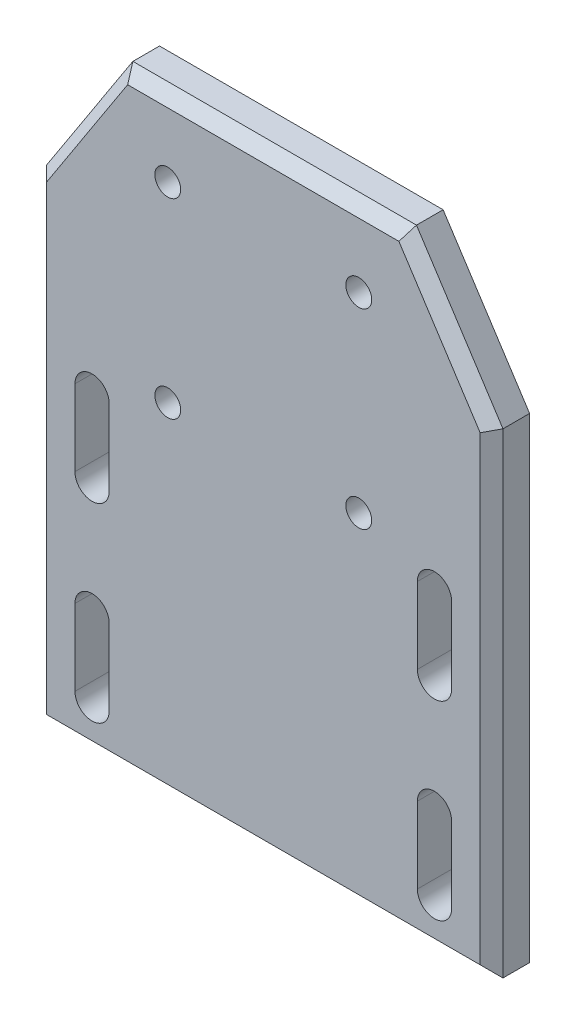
ISO-10303-21;
HEADER;
FILE_DESCRIPTION(('STEP AP214'),'2;1');
FILE_NAME('part.step','',(''),(''),'','','');
FILE_SCHEMA(('AUTOMOTIVE_DESIGN { 1 0 10303 214 1 1 1 1 }'));
ENDSEC;
DATA;
#1=APPLICATION_CONTEXT('core data for automotive mechanical design processes');
#2=APPLICATION_PROTOCOL_DEFINITION('international standard','automotive_design',2000,#1);
#3=PRODUCT_CONTEXT('',#1,'mechanical');
#4=PRODUCT('Part','Part','',(#3));
#5=PRODUCT_RELATED_PRODUCT_CATEGORY('part','',(#4));
#6=PRODUCT_DEFINITION_FORMATION('','',#4);
#7=PRODUCT_DEFINITION_CONTEXT('part definition',#1,'design');
#8=PRODUCT_DEFINITION('design','',#6,#7);
#9=PRODUCT_DEFINITION_SHAPE('','',#8);
#10=(LENGTH_UNIT() NAMED_UNIT(*) SI_UNIT(.MILLI.,.METRE.));
#11=(NAMED_UNIT(*) PLANE_ANGLE_UNIT() SI_UNIT($,.RADIAN.));
#12=(NAMED_UNIT(*) SI_UNIT($,.STERADIAN.) SOLID_ANGLE_UNIT());
#13=UNCERTAINTY_MEASURE_WITH_UNIT(LENGTH_MEASURE(1.E-05),#10,'distance_accuracy_value','');
#14=(GEOMETRIC_REPRESENTATION_CONTEXT(3) GLOBAL_UNCERTAINTY_ASSIGNED_CONTEXT((#13)) GLOBAL_UNIT_ASSIGNED_CONTEXT((#10,
#11,#12)) REPRESENTATION_CONTEXT('',''));
#15=CARTESIAN_POINT('',(0.,0.,0.));
#16=DIRECTION('',(0.,0.,1.));
#17=DIRECTION('',(1.,0.,0.));
#18=AXIS2_PLACEMENT_3D('',#15,#16,#17);
#19=CARTESIAN_POINT('',(-60.,-115.,10.));
#20=DIRECTION('',(0.,0.,1.));
#21=DIRECTION('',(1.,0.,0.));
#22=AXIS2_PLACEMENT_3D('',#19,#20,#21);
#23=PLANE('',#22);
#24=DIRECTION('',(0.,1.,0.));
#25=VECTOR('',#24,1.);
#26=CARTESIAN_POINT('',(57.,9.99999999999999,10.));
#27=LINE('',#26,#25);
#28=CARTESIAN_POINT('',(57.,-112.,10.));
#29=VERTEX_POINT('',#28);
#30=CARTESIAN_POINT('',(57.,9.11135951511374,10.));
#31=VERTEX_POINT('',#30);
#32=EDGE_CURVE('E363',#29,#31,#27,.T.);
#33=ORIENTED_EDGE('',*,*,#32,.T.);
#34=DIRECTION('',(-0.544639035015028,0.838670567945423,0.));
#35=VECTOR('',#34,1.);
#36=CARTESIAN_POINT('',(34.7547225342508,43.3660828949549,10.));
#37=LINE('',#36,#35);
#38=CARTESIAN_POINT('',(35.6418671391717,42.,10.));
#39=VERTEX_POINT('',#38);
#40=EDGE_CURVE('E388',#31,#39,#37,.T.);
#41=ORIENTED_EDGE('',*,*,#40,.T.);
#42=DIRECTION('',(-1.,0.,0.));
#43=VECTOR('',#42,1.);
#44=CARTESIAN_POINT('',(-37.2707342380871,42.,10.));
#45=LINE('',#44,#43);
#46=CARTESIAN_POINT('',(-35.6418671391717,42.,10.));
#47=VERTEX_POINT('',#46);
#48=EDGE_CURVE('E386',#39,#47,#45,.T.);
#49=ORIENTED_EDGE('',*,*,#48,.T.);
#50=DIRECTION('',(-0.544639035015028,-0.838670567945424,0.));
#51=VECTOR('',#50,1.);
#52=CARTESIAN_POINT('',(-57.4839882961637,8.36608289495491,10.));
#53=LINE('',#52,#51);
#54=CARTESIAN_POINT('',(-57.,9.11135951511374,10.));
#55=VERTEX_POINT('',#54);
#56=EDGE_CURVE('E384',#47,#55,#53,.T.);
#57=ORIENTED_EDGE('',*,*,#56,.T.);
#58=DIRECTION('',(0.,-1.,0.));
#59=VECTOR('',#58,1.);
#60=CARTESIAN_POINT('',(-57.,-115.,10.));
#61=LINE('',#60,#59);
#62=CARTESIAN_POINT('',(-57.,-112.,10.));
#63=VERTEX_POINT('',#62);
#64=EDGE_CURVE('E382',#55,#63,#61,.T.);
#65=ORIENTED_EDGE('',*,*,#64,.T.);
#66=DIRECTION('',(1.,0.,0.));
#67=VECTOR('',#66,1.);
#68=CARTESIAN_POINT('',(60.,-112.,10.));
#69=LINE('',#68,#67);
#70=EDGE_CURVE('E380',#63,#29,#69,.T.);
#71=ORIENTED_EDGE('',*,*,#70,.T.);
#72=EDGE_LOOP('',(#33,#41,#49,#57,#65,#71));
#73=FACE_BOUND('',#72,.T.);
#74=CARTESIAN_POINT('',(-25.1022907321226,25.1022907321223,10.));
#75=DIRECTION('',(0.,0.,1.));
#76=DIRECTION('',(1.,0.,0.));
#77=AXIS2_PLACEMENT_3D('',#74,#75,#76);
#78=CIRCLE('',#77,3.39999999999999);
#79=CARTESIAN_POINT('',(-21.7022907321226,25.1022907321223,10.));
#80=VERTEX_POINT('',#79);
#81=EDGE_CURVE('E378',#80,#80,#78,.T.);
#82=ORIENTED_EDGE('',*,*,#81,.F.);
#83=EDGE_LOOP('',(#82));
#84=FACE_BOUND('',#83,.T.);
#85=CARTESIAN_POINT('',(25.102290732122,25.1022907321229,10.));
#86=DIRECTION('',(0.,0.,1.));
#87=DIRECTION('',(1.,0.,0.));
#88=AXIS2_PLACEMENT_3D('',#85,#86,#87);
#89=CIRCLE('',#88,3.39999999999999);
#90=CARTESIAN_POINT('',(28.502290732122,25.1022907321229,10.));
#91=VERTEX_POINT('',#90);
#92=EDGE_CURVE('E374',#91,#91,#89,.T.);
#93=ORIENTED_EDGE('',*,*,#92,.F.);
#94=EDGE_LOOP('',(#93));
#95=FACE_BOUND('',#94,.T.);
#96=CARTESIAN_POINT('',(25.1022907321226,-25.1022907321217,10.));
#97=DIRECTION('',(0.,0.,1.));
#98=DIRECTION('',(1.,0.,0.));
#99=AXIS2_PLACEMENT_3D('',#96,#97,#98);
#100=CIRCLE('',#99,3.39999999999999);
#101=CARTESIAN_POINT('',(28.5022907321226,-25.1022907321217,10.));
#102=VERTEX_POINT('',#101);
#103=EDGE_CURVE('E370',#102,#102,#100,.T.);
#104=ORIENTED_EDGE('',*,*,#103,.F.);
#105=EDGE_LOOP('',(#104));
#106=FACE_BOUND('',#105,.T.);
#107=CARTESIAN_POINT('',(-25.102290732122,-25.1022907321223,10.));
#108=DIRECTION('',(0.,0.,1.));
#109=DIRECTION('',(1.,0.,0.));
#110=AXIS2_PLACEMENT_3D('',#107,#108,#109);
#111=CIRCLE('',#110,3.39999999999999);
#112=CARTESIAN_POINT('',(-21.702290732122,-25.1022907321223,10.));
#113=VERTEX_POINT('',#112);
#114=EDGE_CURVE('E366',#113,#113,#111,.T.);
#115=ORIENTED_EDGE('',*,*,#114,.F.);
#116=EDGE_LOOP('',(#115));
#117=FACE_BOUND('',#116,.T.);
#118=DIRECTION('',(0.,1.,0.));
#119=VECTOR('',#118,1.);
#120=CARTESIAN_POINT('',(49.5,-82.9999999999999,10.));
#121=LINE('',#120,#119);
#122=CARTESIAN_POINT('',(49.5,-103.,10.));
#123=VERTEX_POINT('',#122);
#124=CARTESIAN_POINT('',(49.5,-82.9999999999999,10.));
#125=VERTEX_POINT('',#124);
#126=EDGE_CURVE('E243',#123,#125,#121,.T.);
#127=ORIENTED_EDGE('',*,*,#126,.F.);
#128=CARTESIAN_POINT('',(45.,-103.,10.));
#129=DIRECTION('',(0.,0.,1.));
#130=DIRECTION('',(-1.,0.,0.));
#131=AXIS2_PLACEMENT_3D('',#128,#129,#130);
#132=CIRCLE('',#131,4.5);
#133=CARTESIAN_POINT('',(40.5,-103.,10.));
#134=VERTEX_POINT('',#133);
#135=EDGE_CURVE('E241',#134,#123,#132,.T.);
#136=ORIENTED_EDGE('',*,*,#135,.F.);
#137=DIRECTION('',(0.,-1.,0.));
#138=VECTOR('',#137,1.);
#139=CARTESIAN_POINT('',(40.5,-82.9999999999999,10.));
#140=LINE('',#139,#138);
#141=CARTESIAN_POINT('',(40.5,-82.9999999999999,10.));
#142=VERTEX_POINT('',#141);
#143=EDGE_CURVE('E249',#142,#134,#140,.T.);
#144=ORIENTED_EDGE('',*,*,#143,.F.);
#145=CARTESIAN_POINT('',(45.,-82.9999999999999,10.));
#146=DIRECTION('',(0.,0.,1.));
#147=DIRECTION('',(-1.,0.,0.));
#148=AXIS2_PLACEMENT_3D('',#145,#146,#147);
#149=CIRCLE('',#148,4.5);
#150=EDGE_CURVE('E246',#125,#142,#149,.T.);
#151=ORIENTED_EDGE('',*,*,#150,.F.);
#152=EDGE_LOOP('',(#127,#136,#144,#151));
#153=FACE_BOUND('',#152,.T.);
#154=DIRECTION('',(0.,-1.,0.));
#155=VECTOR('',#154,1.);
#156=CARTESIAN_POINT('',(-49.5,-83.,10.));
#157=LINE('',#156,#155);
#158=CARTESIAN_POINT('',(-49.5,-83.,10.));
#159=VERTEX_POINT('',#158);
#160=CARTESIAN_POINT('',(-49.5,-103.,10.));
#161=VERTEX_POINT('',#160);
#162=EDGE_CURVE('E305',#159,#161,#157,.T.);
#163=ORIENTED_EDGE('',*,*,#162,.F.);
#164=CARTESIAN_POINT('',(-45.,-83.,10.));
#165=DIRECTION('',(0.,0.,1.));
#166=DIRECTION('',(1.,0.,0.));
#167=AXIS2_PLACEMENT_3D('',#164,#165,#166);
#168=CIRCLE('',#167,4.5);
#169=CARTESIAN_POINT('',(-40.5,-83.,10.));
#170=VERTEX_POINT('',#169);
#171=EDGE_CURVE('E303',#170,#159,#168,.T.);
#172=ORIENTED_EDGE('',*,*,#171,.F.);
#173=DIRECTION('',(0.,1.,0.));
#174=VECTOR('',#173,1.);
#175=CARTESIAN_POINT('',(-40.5,-83.,10.));
#176=LINE('',#175,#174);
#177=CARTESIAN_POINT('',(-40.5,-103.,10.));
#178=VERTEX_POINT('',#177);
#179=EDGE_CURVE('E311',#178,#170,#176,.T.);
#180=ORIENTED_EDGE('',*,*,#179,.F.);
#181=CARTESIAN_POINT('',(-45.,-103.,10.));
#182=DIRECTION('',(0.,0.,1.));
#183=DIRECTION('',(1.,0.,0.));
#184=AXIS2_PLACEMENT_3D('',#181,#182,#183);
#185=CIRCLE('',#184,4.5);
#186=EDGE_CURVE('E308',#161,#178,#185,.T.);
#187=ORIENTED_EDGE('',*,*,#186,.F.);
#188=EDGE_LOOP('',(#163,#172,#180,#187));
#189=FACE_BOUND('',#188,.T.);
#190=DIRECTION('',(0.,-1.,0.));
#191=VECTOR('',#190,1.);
#192=CARTESIAN_POINT('',(-49.5,-53.,10.));
#193=LINE('',#192,#191);
#194=CARTESIAN_POINT('',(-49.5,-33.,10.));
#195=VERTEX_POINT('',#194);
#196=CARTESIAN_POINT('',(-49.5,-53.,10.));
#197=VERTEX_POINT('',#196);
#198=EDGE_CURVE('E274',#195,#197,#193,.T.);
#199=ORIENTED_EDGE('',*,*,#198,.F.);
#200=CARTESIAN_POINT('',(-45.,-33.,10.));
#201=DIRECTION('',(0.,0.,1.));
#202=DIRECTION('',(-1.,0.,0.));
#203=AXIS2_PLACEMENT_3D('',#200,#201,#202);
#204=CIRCLE('',#203,4.5);
#205=CARTESIAN_POINT('',(-40.5,-33.,10.));
#206=VERTEX_POINT('',#205);
#207=EDGE_CURVE('E272',#206,#195,#204,.T.);
#208=ORIENTED_EDGE('',*,*,#207,.F.);
#209=DIRECTION('',(0.,1.,0.));
#210=VECTOR('',#209,1.);
#211=CARTESIAN_POINT('',(-40.5,-53.,10.));
#212=LINE('',#211,#210);
#213=CARTESIAN_POINT('',(-40.5,-53.,10.));
#214=VERTEX_POINT('',#213);
#215=EDGE_CURVE('E280',#214,#206,#212,.T.);
#216=ORIENTED_EDGE('',*,*,#215,.F.);
#217=CARTESIAN_POINT('',(-45.,-53.,10.));
#218=DIRECTION('',(0.,0.,1.));
#219=DIRECTION('',(-1.,0.,0.));
#220=AXIS2_PLACEMENT_3D('',#217,#218,#219);
#221=CIRCLE('',#220,4.5);
#222=EDGE_CURVE('E277',#197,#214,#221,.T.);
#223=ORIENTED_EDGE('',*,*,#222,.F.);
#224=EDGE_LOOP('',(#199,#208,#216,#223));
#225=FACE_BOUND('',#224,.T.);
#226=DIRECTION('',(0.,1.,0.));
#227=VECTOR('',#226,1.);
#228=CARTESIAN_POINT('',(49.5,-53.,10.));
#229=LINE('',#228,#227);
#230=CARTESIAN_POINT('',(49.5,-53.,10.));
#231=VERTEX_POINT('',#230);
#232=CARTESIAN_POINT('',(49.5,-32.9999999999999,10.));
#233=VERTEX_POINT('',#232);
#234=EDGE_CURVE('E208',#231,#233,#229,.T.);
#235=ORIENTED_EDGE('',*,*,#234,.F.);
#236=CARTESIAN_POINT('',(45.,-53.,10.));
#237=DIRECTION('',(0.,0.,1.));
#238=DIRECTION('',(1.,0.,0.));
#239=AXIS2_PLACEMENT_3D('',#236,#237,#238);
#240=CIRCLE('',#239,4.5);
#241=CARTESIAN_POINT('',(40.5,-53.,10.));
#242=VERTEX_POINT('',#241);
#243=EDGE_CURVE('E198',#242,#231,#240,.T.);
#244=ORIENTED_EDGE('',*,*,#243,.F.);
#245=DIRECTION('',(0.,-1.,0.));
#246=VECTOR('',#245,1.);
#247=CARTESIAN_POINT('',(40.5,-53.,10.));
#248=LINE('',#247,#246);
#249=CARTESIAN_POINT('',(40.5,-32.9999999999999,10.));
#250=VERTEX_POINT('',#249);
#251=EDGE_CURVE('E223',#250,#242,#248,.T.);
#252=ORIENTED_EDGE('',*,*,#251,.F.);
#253=CARTESIAN_POINT('',(45.,-32.9999999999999,10.));
#254=DIRECTION('',(0.,0.,1.));
#255=DIRECTION('',(1.,0.,0.));
#256=AXIS2_PLACEMENT_3D('',#253,#254,#255);
#257=CIRCLE('',#256,4.5);
#258=EDGE_CURVE('E221',#233,#250,#257,.T.);
#259=ORIENTED_EDGE('',*,*,#258,.F.);
#260=EDGE_LOOP('',(#235,#244,#252,#259));
#261=FACE_BOUND('',#260,.T.);
#262=ADVANCED_FACE('F30',(#73,#84,#95,#106,#117,#153,#189,#225,#261),#23,.T.);
#263=CARTESIAN_POINT('',(-60.,-115.,0.));
#264=DIRECTION('',(0.,0.,1.));
#265=DIRECTION('',(1.,0.,0.));
#266=AXIS2_PLACEMENT_3D('',#263,#264,#265);
#267=PLANE('',#266);
#268=CARTESIAN_POINT('',(-25.1022907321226,25.1022907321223,0.));
#269=DIRECTION('',(0.,0.,1.));
#270=DIRECTION('',(1.,0.,0.));
#271=AXIS2_PLACEMENT_3D('',#268,#269,#270);
#272=CIRCLE('',#271,3.39999999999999);
#273=CARTESIAN_POINT('',(-21.7022907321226,25.1022907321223,0.));
#274=VERTEX_POINT('',#273);
#275=EDGE_CURVE('E375',#274,#274,#272,.T.);
#276=ORIENTED_EDGE('',*,*,#275,.T.);
#277=EDGE_LOOP('',(#276));
#278=FACE_BOUND('',#277,.T.);
#279=CARTESIAN_POINT('',(25.102290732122,25.1022907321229,0.));
#280=DIRECTION('',(0.,0.,1.));
#281=DIRECTION('',(1.,0.,0.));
#282=AXIS2_PLACEMENT_3D('',#279,#280,#281);
#283=CIRCLE('',#282,3.39999999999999);
#284=CARTESIAN_POINT('',(28.502290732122,25.1022907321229,0.));
#285=VERTEX_POINT('',#284);
#286=EDGE_CURVE('E371',#285,#285,#283,.T.);
#287=ORIENTED_EDGE('',*,*,#286,.T.);
#288=EDGE_LOOP('',(#287));
#289=FACE_BOUND('',#288,.T.);
#290=CARTESIAN_POINT('',(25.1022907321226,-25.1022907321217,0.));
#291=DIRECTION('',(0.,0.,1.));
#292=DIRECTION('',(1.,0.,0.));
#293=AXIS2_PLACEMENT_3D('',#290,#291,#292);
#294=CIRCLE('',#293,3.39999999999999);
#295=CARTESIAN_POINT('',(28.5022907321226,-25.1022907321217,0.));
#296=VERTEX_POINT('',#295);
#297=EDGE_CURVE('E367',#296,#296,#294,.T.);
#298=ORIENTED_EDGE('',*,*,#297,.T.);
#299=EDGE_LOOP('',(#298));
#300=FACE_BOUND('',#299,.T.);
#301=CARTESIAN_POINT('',(-25.102290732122,-25.1022907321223,0.));
#302=DIRECTION('',(0.,0.,1.));
#303=DIRECTION('',(1.,0.,0.));
#304=AXIS2_PLACEMENT_3D('',#301,#302,#303);
#305=CIRCLE('',#304,3.39999999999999);
#306=CARTESIAN_POINT('',(-21.702290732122,-25.1022907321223,0.));
#307=VERTEX_POINT('',#306);
#308=EDGE_CURVE('E230',#307,#307,#305,.T.);
#309=ORIENTED_EDGE('',*,*,#308,.T.);
#310=EDGE_LOOP('',(#309));
#311=FACE_BOUND('',#310,.T.);
#312=CARTESIAN_POINT('',(45.,-103.,0.));
#313=DIRECTION('',(0.,0.,1.));
#314=DIRECTION('',(-1.,0.,0.));
#315=AXIS2_PLACEMENT_3D('',#312,#313,#314);
#316=CIRCLE('',#315,4.5);
#317=CARTESIAN_POINT('',(40.5,-103.,0.));
#318=VERTEX_POINT('',#317);
#319=CARTESIAN_POINT('',(49.5,-103.,0.));
#320=VERTEX_POINT('',#319);
#321=EDGE_CURVE('E216',#318,#320,#316,.T.);
#322=ORIENTED_EDGE('',*,*,#321,.T.);
#323=DIRECTION('',(0.,1.,0.));
#324=VECTOR('',#323,1.);
#325=CARTESIAN_POINT('',(49.5,-82.9999999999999,0.));
#326=LINE('',#325,#324);
#327=CARTESIAN_POINT('',(49.5,-82.9999999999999,0.));
#328=VERTEX_POINT('',#327);
#329=EDGE_CURVE('E254',#320,#328,#326,.T.);
#330=ORIENTED_EDGE('',*,*,#329,.T.);
#331=CARTESIAN_POINT('',(45.,-82.9999999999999,0.));
#332=DIRECTION('',(0.,0.,1.));
#333=DIRECTION('',(-1.,0.,0.));
#334=AXIS2_PLACEMENT_3D('',#331,#332,#333);
#335=CIRCLE('',#334,4.5);
#336=CARTESIAN_POINT('',(40.5,-82.9999999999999,0.));
#337=VERTEX_POINT('',#336);
#338=EDGE_CURVE('E257',#328,#337,#335,.T.);
#339=ORIENTED_EDGE('',*,*,#338,.T.);
#340=DIRECTION('',(0.,-1.,0.));
#341=VECTOR('',#340,1.);
#342=CARTESIAN_POINT('',(40.5,-82.9999999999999,0.));
#343=LINE('',#342,#341);
#344=EDGE_CURVE('E244',#337,#318,#343,.T.);
#345=ORIENTED_EDGE('',*,*,#344,.T.);
#346=EDGE_LOOP('',(#322,#330,#339,#345));
#347=FACE_BOUND('',#346,.T.);
#348=CARTESIAN_POINT('',(-45.,-83.,0.));
#349=DIRECTION('',(0.,0.,1.));
#350=DIRECTION('',(1.,0.,0.));
#351=AXIS2_PLACEMENT_3D('',#348,#349,#350);
#352=CIRCLE('',#351,4.5);
#353=CARTESIAN_POINT('',(-40.5,-83.,0.));
#354=VERTEX_POINT('',#353);
#355=CARTESIAN_POINT('',(-49.5,-83.,0.));
#356=VERTEX_POINT('',#355);
#357=EDGE_CURVE('E302',#354,#356,#352,.T.);
#358=ORIENTED_EDGE('',*,*,#357,.T.);
#359=DIRECTION('',(0.,-1.,0.));
#360=VECTOR('',#359,1.);
#361=CARTESIAN_POINT('',(-49.5,-83.,0.));
#362=LINE('',#361,#360);
#363=CARTESIAN_POINT('',(-49.5,-103.,0.));
#364=VERTEX_POINT('',#363);
#365=EDGE_CURVE('E316',#356,#364,#362,.T.);
#366=ORIENTED_EDGE('',*,*,#365,.T.);
#367=CARTESIAN_POINT('',(-45.,-103.,0.));
#368=DIRECTION('',(0.,0.,1.));
#369=DIRECTION('',(1.,0.,0.));
#370=AXIS2_PLACEMENT_3D('',#367,#368,#369);
#371=CIRCLE('',#370,4.5);
#372=CARTESIAN_POINT('',(-40.5,-103.,0.));
#373=VERTEX_POINT('',#372);
#374=EDGE_CURVE('E319',#364,#373,#371,.T.);
#375=ORIENTED_EDGE('',*,*,#374,.T.);
#376=DIRECTION('',(0.,1.,0.));
#377=VECTOR('',#376,1.);
#378=CARTESIAN_POINT('',(-40.5,-83.,0.));
#379=LINE('',#378,#377);
#380=EDGE_CURVE('E306',#373,#354,#379,.T.);
#381=ORIENTED_EDGE('',*,*,#380,.T.);
#382=EDGE_LOOP('',(#358,#366,#375,#381));
#383=FACE_BOUND('',#382,.T.);
#384=DIRECTION('',(0.,-1.,0.));
#385=VECTOR('',#384,1.);
#386=CARTESIAN_POINT('',(-60.,9.99999999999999,0.));
#387=LINE('',#386,#385);
#388=CARTESIAN_POINT('',(-60.,9.99999999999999,0.));
#389=VERTEX_POINT('',#388);
#390=CARTESIAN_POINT('',(-60.,-115.,0.));
#391=VERTEX_POINT('',#390);
#392=EDGE_CURVE('E333',#389,#391,#387,.T.);
#393=ORIENTED_EDGE('',*,*,#392,.F.);
#394=DIRECTION('',(-0.544639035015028,-0.838670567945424,0.));
#395=VECTOR('',#394,1.);
#396=CARTESIAN_POINT('',(-37.2707342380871,45.,0.));
#397=LINE('',#396,#395);
#398=CARTESIAN_POINT('',(-37.2707342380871,45.,0.));
#399=VERTEX_POINT('',#398);
#400=EDGE_CURVE('E348',#399,#389,#397,.T.);
#401=ORIENTED_EDGE('',*,*,#400,.F.);
#402=DIRECTION('',(-1.,0.,0.));
#403=VECTOR('',#402,1.);
#404=CARTESIAN_POINT('',(37.2707342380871,45.,0.));
#405=LINE('',#404,#403);
#406=CARTESIAN_POINT('',(37.2707342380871,45.,0.));
#407=VERTEX_POINT('',#406);
#408=EDGE_CURVE('E345',#407,#399,#405,.T.);
#409=ORIENTED_EDGE('',*,*,#408,.F.);
#410=DIRECTION('',(-0.544639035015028,0.838670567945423,0.));
#411=VECTOR('',#410,1.);
#412=CARTESIAN_POINT('',(60.,9.99999999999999,0.));
#413=LINE('',#412,#411);
#414=CARTESIAN_POINT('',(60.,9.99999999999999,0.));
#415=VERTEX_POINT('',#414);
#416=EDGE_CURVE('E342',#415,#407,#413,.T.);
#417=ORIENTED_EDGE('',*,*,#416,.F.);
#418=DIRECTION('',(0.,1.,0.));
#419=VECTOR('',#418,1.);
#420=CARTESIAN_POINT('',(60.,-115.,0.));
#421=LINE('',#420,#419);
#422=CARTESIAN_POINT('',(60.,-115.,0.));
#423=VERTEX_POINT('',#422);
#424=EDGE_CURVE('E339',#423,#415,#421,.T.);
#425=ORIENTED_EDGE('',*,*,#424,.F.);
#426=DIRECTION('',(1.,0.,0.));
#427=VECTOR('',#426,1.);
#428=CARTESIAN_POINT('',(-60.,-115.,0.));
#429=LINE('',#428,#427);
#430=EDGE_CURVE('E336',#391,#423,#429,.T.);
#431=ORIENTED_EDGE('',*,*,#430,.F.);
#432=EDGE_LOOP('',(#393,#401,#409,#417,#425,#431));
#433=FACE_BOUND('',#432,.T.);
#434=CARTESIAN_POINT('',(-45.,-33.,0.));
#435=DIRECTION('',(0.,0.,1.));
#436=DIRECTION('',(-1.,0.,0.));
#437=AXIS2_PLACEMENT_3D('',#434,#435,#436);
#438=CIRCLE('',#437,4.5);
#439=CARTESIAN_POINT('',(-40.5,-33.,0.));
#440=VERTEX_POINT('',#439);
#441=CARTESIAN_POINT('',(-49.5,-33.,0.));
#442=VERTEX_POINT('',#441);
#443=EDGE_CURVE('E271',#440,#442,#438,.T.);
#444=ORIENTED_EDGE('',*,*,#443,.T.);
#445=DIRECTION('',(0.,-1.,0.));
#446=VECTOR('',#445,1.);
#447=CARTESIAN_POINT('',(-49.5,-53.,0.));
#448=LINE('',#447,#446);
#449=CARTESIAN_POINT('',(-49.5,-53.,0.));
#450=VERTEX_POINT('',#449);
#451=EDGE_CURVE('E285',#442,#450,#448,.T.);
#452=ORIENTED_EDGE('',*,*,#451,.T.);
#453=CARTESIAN_POINT('',(-45.,-53.,0.));
#454=DIRECTION('',(0.,0.,1.));
#455=DIRECTION('',(-1.,0.,0.));
#456=AXIS2_PLACEMENT_3D('',#453,#454,#455);
#457=CIRCLE('',#456,4.5);
#458=CARTESIAN_POINT('',(-40.5,-53.,0.));
#459=VERTEX_POINT('',#458);
#460=EDGE_CURVE('E288',#450,#459,#457,.T.);
#461=ORIENTED_EDGE('',*,*,#460,.T.);
#462=DIRECTION('',(0.,1.,0.));
#463=VECTOR('',#462,1.);
#464=CARTESIAN_POINT('',(-40.5,-53.,0.));
#465=LINE('',#464,#463);
#466=EDGE_CURVE('E275',#459,#440,#465,.T.);
#467=ORIENTED_EDGE('',*,*,#466,.T.);
#468=EDGE_LOOP('',(#444,#452,#461,#467));
#469=FACE_BOUND('',#468,.T.);
#470=CARTESIAN_POINT('',(45.,-53.,0.));
#471=DIRECTION('',(0.,0.,1.));
#472=DIRECTION('',(1.,0.,0.));
#473=AXIS2_PLACEMENT_3D('',#470,#471,#472);
#474=CIRCLE('',#473,4.5);
#475=CARTESIAN_POINT('',(40.5,-53.,0.));
#476=VERTEX_POINT('',#475);
#477=CARTESIAN_POINT('',(49.5,-53.,0.));
#478=VERTEX_POINT('',#477);
#479=EDGE_CURVE('E228',#476,#478,#474,.T.);
#480=ORIENTED_EDGE('',*,*,#479,.T.);
#481=DIRECTION('',(0.,1.,0.));
#482=VECTOR('',#481,1.);
#483=CARTESIAN_POINT('',(49.5,-53.,0.));
#484=LINE('',#483,#482);
#485=CARTESIAN_POINT('',(49.5,-32.9999999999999,0.));
#486=VERTEX_POINT('',#485);
#487=EDGE_CURVE('E215',#478,#486,#484,.T.);
#488=ORIENTED_EDGE('',*,*,#487,.T.);
#489=CARTESIAN_POINT('',(45.,-32.9999999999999,0.));
#490=DIRECTION('',(0.,0.,1.));
#491=DIRECTION('',(1.,0.,0.));
#492=AXIS2_PLACEMENT_3D('',#489,#490,#491);
#493=CIRCLE('',#492,4.5);
#494=CARTESIAN_POINT('',(40.5,-32.9999999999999,0.));
#495=VERTEX_POINT('',#494);
#496=EDGE_CURVE('E232',#486,#495,#493,.T.);
#497=ORIENTED_EDGE('',*,*,#496,.T.);
#498=DIRECTION('',(0.,-1.,0.));
#499=VECTOR('',#498,1.);
#500=CARTESIAN_POINT('',(40.5,-53.,0.));
#501=LINE('',#500,#499);
#502=EDGE_CURVE('E209',#495,#476,#501,.T.);
#503=ORIENTED_EDGE('',*,*,#502,.T.);
#504=EDGE_LOOP('',(#480,#488,#497,#503));
#505=FACE_BOUND('',#504,.T.);
#506=ADVANCED_FACE('F436',(#278,#289,#300,#311,#347,#383,#433,#469,#505),#267,.F.);
#507=CARTESIAN_POINT('',(-60.,9.99999999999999,10.));
#508=DIRECTION('',(1.,0.,0.));
#509=DIRECTION('',(0.,1.,0.));
#510=AXIS2_PLACEMENT_3D('',#507,#508,#509);
#511=PLANE('',#510);
#512=DIRECTION('',(0.,0.,-1.));
#513=VECTOR('',#512,1.);
#514=CARTESIAN_POINT('',(-60.,-115.,10.));
#515=LINE('',#514,#513);
#516=CARTESIAN_POINT('',(-60.,-115.,7.));
#517=VERTEX_POINT('',#516);
#518=EDGE_CURVE('E361',#517,#391,#515,.T.);
#519=ORIENTED_EDGE('',*,*,#518,.F.);
#520=DIRECTION('',(0.,1.,0.));
#521=VECTOR('',#520,1.);
#522=CARTESIAN_POINT('',(-60.,9.99999999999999,7.));
#523=LINE('',#522,#521);
#524=CARTESIAN_POINT('',(-60.,9.99999999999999,7.));
#525=VERTEX_POINT('',#524);
#526=EDGE_CURVE('E398',#517,#525,#523,.T.);
#527=ORIENTED_EDGE('',*,*,#526,.T.);
#528=DIRECTION('',(0.,0.,-1.));
#529=VECTOR('',#528,1.);
#530=CARTESIAN_POINT('',(-60.,9.99999999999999,10.));
#531=LINE('',#530,#529);
#532=EDGE_CURVE('E351',#525,#389,#531,.T.);
#533=ORIENTED_EDGE('',*,*,#532,.T.);
#534=ORIENTED_EDGE('',*,*,#392,.T.);
#535=EDGE_LOOP('',(#519,#527,#533,#534));
#536=FACE_BOUND('',#535,.T.);
#537=ADVANCED_FACE('F502',(#536),#511,.F.);
#538=CARTESIAN_POINT('',(-60.,-115.,10.));
#539=DIRECTION('',(0.,1.,0.));
#540=DIRECTION('',(-1.,0.,0.));
#541=AXIS2_PLACEMENT_3D('',#538,#539,#540);
#542=PLANE('',#541);
#543=DIRECTION('',(0.,0.,-1.));
#544=VECTOR('',#543,1.);
#545=CARTESIAN_POINT('',(60.,-115.,10.));
#546=LINE('',#545,#544);
#547=CARTESIAN_POINT('',(60.,-115.,7.));
#548=VERTEX_POINT('',#547);
#549=EDGE_CURVE('E359',#548,#423,#546,.T.);
#550=ORIENTED_EDGE('',*,*,#549,.F.);
#551=DIRECTION('',(-1.,0.,0.));
#552=VECTOR('',#551,1.);
#553=CARTESIAN_POINT('',(-60.,-115.,7.));
#554=LINE('',#553,#552);
#555=EDGE_CURVE('E39',#548,#517,#554,.T.);
#556=ORIENTED_EDGE('',*,*,#555,.T.);
#557=ORIENTED_EDGE('',*,*,#518,.T.);
#558=ORIENTED_EDGE('',*,*,#430,.T.);
#559=EDGE_LOOP('',(#550,#556,#557,#558));
#560=FACE_BOUND('',#559,.T.);
#561=ADVANCED_FACE('F518',(#560),#542,.F.);
#562=CARTESIAN_POINT('',(60.,-115.,10.));
#563=DIRECTION('',(-1.,0.,0.));
#564=DIRECTION('',(0.,-1.,0.));
#565=AXIS2_PLACEMENT_3D('',#562,#563,#564);
#566=PLANE('',#565);
#567=DIRECTION('',(0.,0.,-1.));
#568=VECTOR('',#567,1.);
#569=CARTESIAN_POINT('',(60.,9.99999999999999,10.));
#570=LINE('',#569,#568);
#571=CARTESIAN_POINT('',(60.,9.99999999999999,7.));
#572=VERTEX_POINT('',#571);
#573=EDGE_CURVE('E357',#572,#415,#570,.T.);
#574=ORIENTED_EDGE('',*,*,#573,.F.);
#575=DIRECTION('',(0.,-1.,0.));
#576=VECTOR('',#575,1.);
#577=CARTESIAN_POINT('',(60.,-115.,7.));
#578=LINE('',#577,#576);
#579=EDGE_CURVE('E11',#572,#548,#578,.T.);
#580=ORIENTED_EDGE('',*,*,#579,.T.);
#581=ORIENTED_EDGE('',*,*,#549,.T.);
#582=ORIENTED_EDGE('',*,*,#424,.T.);
#583=EDGE_LOOP('',(#574,#580,#581,#582));
#584=FACE_BOUND('',#583,.T.);
#585=ADVANCED_FACE('F514',(#584),#566,.F.);
#586=CARTESIAN_POINT('',(60.,9.99999999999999,10.));
#587=DIRECTION('',(-0.838670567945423,-0.544639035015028,0.));
#588=DIRECTION('',(0.544639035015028,-0.838670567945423,0.));
#589=AXIS2_PLACEMENT_3D('',#586,#587,#588);
#590=PLANE('',#589);
#591=DIRECTION('',(0.,0.,-1.));
#592=VECTOR('',#591,1.);
#593=CARTESIAN_POINT('',(37.2707342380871,45.,10.));
#594=LINE('',#593,#592);
#595=CARTESIAN_POINT('',(37.2707342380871,45.,7.));
#596=VERTEX_POINT('',#595);
#597=EDGE_CURVE('E355',#596,#407,#594,.T.);
#598=ORIENTED_EDGE('',*,*,#597,.F.);
#599=DIRECTION('',(0.544639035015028,-0.838670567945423,0.));
#600=VECTOR('',#599,1.);
#601=CARTESIAN_POINT('',(60.,9.99999999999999,7.));
#602=LINE('',#601,#600);
#603=EDGE_CURVE('E391',#596,#572,#602,.T.);
#604=ORIENTED_EDGE('',*,*,#603,.T.);
#605=ORIENTED_EDGE('',*,*,#573,.T.);
#606=ORIENTED_EDGE('',*,*,#416,.T.);
#607=EDGE_LOOP('',(#598,#604,#605,#606));
#608=FACE_BOUND('',#607,.T.);
#609=ADVANCED_FACE('F510',(#608),#590,.F.);
#610=CARTESIAN_POINT('',(37.2707342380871,45.,10.));
#611=DIRECTION('',(0.,-1.,0.));
#612=DIRECTION('',(1.,0.,0.));
#613=AXIS2_PLACEMENT_3D('',#610,#611,#612);
#614=PLANE('',#613);
#615=DIRECTION('',(0.,0.,-1.));
#616=VECTOR('',#615,1.);
#617=CARTESIAN_POINT('',(-37.2707342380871,45.,10.));
#618=LINE('',#617,#616);
#619=CARTESIAN_POINT('',(-37.2707342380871,45.,7.));
#620=VERTEX_POINT('',#619);
#621=EDGE_CURVE('E353',#620,#399,#618,.T.);
#622=ORIENTED_EDGE('',*,*,#621,.F.);
#623=DIRECTION('',(1.,0.,0.));
#624=VECTOR('',#623,1.);
#625=CARTESIAN_POINT('',(37.2707342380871,45.,7.));
#626=LINE('',#625,#624);
#627=EDGE_CURVE('E394',#620,#596,#626,.T.);
#628=ORIENTED_EDGE('',*,*,#627,.T.);
#629=ORIENTED_EDGE('',*,*,#597,.T.);
#630=ORIENTED_EDGE('',*,*,#408,.T.);
#631=EDGE_LOOP('',(#622,#628,#629,#630));
#632=FACE_BOUND('',#631,.T.);
#633=ADVANCED_FACE('F506',(#632),#614,.F.);
#634=CARTESIAN_POINT('',(-37.2707342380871,45.,10.));
#635=DIRECTION('',(0.838670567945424,-0.544639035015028,0.));
#636=DIRECTION('',(0.544639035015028,0.838670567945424,0.));
#637=AXIS2_PLACEMENT_3D('',#634,#635,#636);
#638=PLANE('',#637);
#639=ORIENTED_EDGE('',*,*,#532,.F.);
#640=DIRECTION('',(0.544639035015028,0.838670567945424,0.));
#641=VECTOR('',#640,1.);
#642=CARTESIAN_POINT('',(-37.2707342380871,45.,7.));
#643=LINE('',#642,#641);
#644=EDGE_CURVE('E396',#525,#620,#643,.T.);
#645=ORIENTED_EDGE('',*,*,#644,.T.);
#646=ORIENTED_EDGE('',*,*,#621,.T.);
#647=ORIENTED_EDGE('',*,*,#400,.T.);
#648=EDGE_LOOP('',(#639,#645,#646,#647));
#649=FACE_BOUND('',#648,.T.);
#650=ADVANCED_FACE('F497',(#649),#638,.F.);
#651=CARTESIAN_POINT('',(-45.,-83.,10.));
#652=DIRECTION('',(0.,0.,-1.));
#653=DIRECTION('',(-1.,0.,0.));
#654=AXIS2_PLACEMENT_3D('',#651,#652,#653);
#655=CYLINDRICAL_SURFACE('',#654,4.5);
#656=ORIENTED_EDGE('',*,*,#357,.F.);
#657=DIRECTION('',(0.,0.,-1.));
#658=VECTOR('',#657,1.);
#659=CARTESIAN_POINT('',(-40.5,-83.,10.));
#660=LINE('',#659,#658);
#661=EDGE_CURVE('E313',#170,#354,#660,.T.);
#662=ORIENTED_EDGE('',*,*,#661,.F.);
#663=ORIENTED_EDGE('',*,*,#171,.T.);
#664=DIRECTION('',(0.,0.,-1.));
#665=VECTOR('',#664,1.);
#666=CARTESIAN_POINT('',(-49.5,-83.,10.));
#667=LINE('',#666,#665);
#668=EDGE_CURVE('E330',#159,#356,#667,.T.);
#669=ORIENTED_EDGE('',*,*,#668,.T.);
#670=EDGE_LOOP('',(#656,#662,#663,#669));
#671=FACE_BOUND('',#670,.T.);
#672=ADVANCED_FACE('F494',(#671),#655,.F.);
#673=CARTESIAN_POINT('',(-49.5,-83.,10.));
#674=DIRECTION('',(1.,0.,0.));
#675=DIRECTION('',(0.,0.,-1.));
#676=AXIS2_PLACEMENT_3D('',#673,#674,#675);
#677=PLANE('',#676);
#678=ORIENTED_EDGE('',*,*,#365,.F.);
#679=ORIENTED_EDGE('',*,*,#668,.F.);
#680=ORIENTED_EDGE('',*,*,#162,.T.);
#681=DIRECTION('',(0.,0.,-1.));
#682=VECTOR('',#681,1.);
#683=CARTESIAN_POINT('',(-49.5,-103.,10.));
#684=LINE('',#683,#682);
#685=EDGE_CURVE('E328',#161,#364,#684,.T.);
#686=ORIENTED_EDGE('',*,*,#685,.T.);
#687=EDGE_LOOP('',(#678,#679,#680,#686));
#688=FACE_BOUND('',#687,.T.);
#689=ADVANCED_FACE('F490',(#688),#677,.T.);
#690=CARTESIAN_POINT('',(-45.,-103.,10.));
#691=DIRECTION('',(0.,0.,-1.));
#692=DIRECTION('',(-1.,0.,0.));
#693=AXIS2_PLACEMENT_3D('',#690,#691,#692);
#694=CYLINDRICAL_SURFACE('',#693,4.5);
#695=ORIENTED_EDGE('',*,*,#374,.F.);
#696=ORIENTED_EDGE('',*,*,#685,.F.);
#697=ORIENTED_EDGE('',*,*,#186,.T.);
#698=DIRECTION('',(0.,0.,-1.));
#699=VECTOR('',#698,1.);
#700=CARTESIAN_POINT('',(-40.5,-103.,10.));
#701=LINE('',#700,#699);
#702=EDGE_CURVE('E326',#178,#373,#701,.T.);
#703=ORIENTED_EDGE('',*,*,#702,.T.);
#704=EDGE_LOOP('',(#695,#696,#697,#703));
#705=FACE_BOUND('',#704,.T.);
#706=ADVANCED_FACE('F486',(#705),#694,.F.);
#707=CARTESIAN_POINT('',(-40.5,-83.,10.));
#708=DIRECTION('',(-1.,0.,0.));
#709=DIRECTION('',(0.,0.,1.));
#710=AXIS2_PLACEMENT_3D('',#707,#708,#709);
#711=PLANE('',#710);
#712=ORIENTED_EDGE('',*,*,#380,.F.);
#713=ORIENTED_EDGE('',*,*,#702,.F.);
#714=ORIENTED_EDGE('',*,*,#179,.T.);
#715=ORIENTED_EDGE('',*,*,#661,.T.);
#716=EDGE_LOOP('',(#712,#713,#714,#715));
#717=FACE_BOUND('',#716,.T.);
#718=ADVANCED_FACE('F483',(#717),#711,.T.);
#719=CARTESIAN_POINT('',(-45.,-33.,10.));
#720=DIRECTION('',(0.,0.,-1.));
#721=DIRECTION('',(-1.,0.,0.));
#722=AXIS2_PLACEMENT_3D('',#719,#720,#721);
#723=CYLINDRICAL_SURFACE('',#722,4.5);
#724=ORIENTED_EDGE('',*,*,#443,.F.);
#725=DIRECTION('',(0.,0.,-1.));
#726=VECTOR('',#725,1.);
#727=CARTESIAN_POINT('',(-40.5,-33.,10.));
#728=LINE('',#727,#726);
#729=EDGE_CURVE('E282',#206,#440,#728,.T.);
#730=ORIENTED_EDGE('',*,*,#729,.F.);
#731=ORIENTED_EDGE('',*,*,#207,.T.);
#732=DIRECTION('',(0.,0.,-1.));
#733=VECTOR('',#732,1.);
#734=CARTESIAN_POINT('',(-49.5,-33.,10.));
#735=LINE('',#734,#733);
#736=EDGE_CURVE('E299',#195,#442,#735,.T.);
#737=ORIENTED_EDGE('',*,*,#736,.T.);
#738=EDGE_LOOP('',(#724,#730,#731,#737));
#739=FACE_BOUND('',#738,.T.);
#740=ADVANCED_FACE('F462',(#739),#723,.F.);
#741=CARTESIAN_POINT('',(-49.5,-53.,10.));
#742=DIRECTION('',(1.,0.,0.));
#743=DIRECTION('',(0.,0.,-1.));
#744=AXIS2_PLACEMENT_3D('',#741,#742,#743);
#745=PLANE('',#744);
#746=ORIENTED_EDGE('',*,*,#451,.F.);
#747=ORIENTED_EDGE('',*,*,#736,.F.);
#748=ORIENTED_EDGE('',*,*,#198,.T.);
#749=DIRECTION('',(0.,0.,-1.));
#750=VECTOR('',#749,1.);
#751=CARTESIAN_POINT('',(-49.5,-53.,10.));
#752=LINE('',#751,#750);
#753=EDGE_CURVE('E297',#197,#450,#752,.T.);
#754=ORIENTED_EDGE('',*,*,#753,.T.);
#755=EDGE_LOOP('',(#746,#747,#748,#754));
#756=FACE_BOUND('',#755,.T.);
#757=ADVANCED_FACE('F454',(#756),#745,.T.);
#758=CARTESIAN_POINT('',(-45.,-53.,10.));
#759=DIRECTION('',(0.,0.,-1.));
#760=DIRECTION('',(-1.,0.,0.));
#761=AXIS2_PLACEMENT_3D('',#758,#759,#760);
#762=CYLINDRICAL_SURFACE('',#761,4.5);
#763=ORIENTED_EDGE('',*,*,#460,.F.);
#764=ORIENTED_EDGE('',*,*,#753,.F.);
#765=ORIENTED_EDGE('',*,*,#222,.T.);
#766=DIRECTION('',(0.,0.,-1.));
#767=VECTOR('',#766,1.);
#768=CARTESIAN_POINT('',(-40.5,-53.,10.));
#769=LINE('',#768,#767);
#770=EDGE_CURVE('E295',#214,#459,#769,.T.);
#771=ORIENTED_EDGE('',*,*,#770,.T.);
#772=EDGE_LOOP('',(#763,#764,#765,#771));
#773=FACE_BOUND('',#772,.T.);
#774=ADVANCED_FACE('F457',(#773),#762,.F.);
#775=CARTESIAN_POINT('',(-40.5,-53.,10.));
#776=DIRECTION('',(-1.,0.,0.));
#777=DIRECTION('',(0.,0.,1.));
#778=AXIS2_PLACEMENT_3D('',#775,#776,#777);
#779=PLANE('',#778);
#780=ORIENTED_EDGE('',*,*,#466,.F.);
#781=ORIENTED_EDGE('',*,*,#770,.F.);
#782=ORIENTED_EDGE('',*,*,#215,.T.);
#783=ORIENTED_EDGE('',*,*,#729,.T.);
#784=EDGE_LOOP('',(#780,#781,#782,#783));
#785=FACE_BOUND('',#784,.T.);
#786=ADVANCED_FACE('F465',(#785),#779,.T.);
#787=CARTESIAN_POINT('',(45.,-103.,10.));
#788=DIRECTION('',(0.,0.,-1.));
#789=DIRECTION('',(-1.,0.,0.));
#790=AXIS2_PLACEMENT_3D('',#787,#788,#789);
#791=CYLINDRICAL_SURFACE('',#790,4.5);
#792=ORIENTED_EDGE('',*,*,#321,.F.);
#793=DIRECTION('',(0.,0.,-1.));
#794=VECTOR('',#793,1.);
#795=CARTESIAN_POINT('',(40.5,-103.,10.));
#796=LINE('',#795,#794);
#797=EDGE_CURVE('E251',#134,#318,#796,.T.);
#798=ORIENTED_EDGE('',*,*,#797,.F.);
#799=ORIENTED_EDGE('',*,*,#135,.T.);
#800=DIRECTION('',(0.,0.,-1.));
#801=VECTOR('',#800,1.);
#802=CARTESIAN_POINT('',(49.5,-103.,10.));
#803=LINE('',#802,#801);
#804=EDGE_CURVE('E268',#123,#320,#803,.T.);
#805=ORIENTED_EDGE('',*,*,#804,.T.);
#806=EDGE_LOOP('',(#792,#798,#799,#805));
#807=FACE_BOUND('',#806,.T.);
#808=ADVANCED_FACE('F467',(#807),#791,.F.);
#809=CARTESIAN_POINT('',(49.5,-82.9999999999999,10.));
#810=DIRECTION('',(-1.,0.,0.));
#811=DIRECTION('',(0.,0.,1.));
#812=AXIS2_PLACEMENT_3D('',#809,#810,#811);
#813=PLANE('',#812);
#814=ORIENTED_EDGE('',*,*,#329,.F.);
#815=ORIENTED_EDGE('',*,*,#804,.F.);
#816=ORIENTED_EDGE('',*,*,#126,.T.);
#817=DIRECTION('',(0.,0.,-1.));
#818=VECTOR('',#817,1.);
#819=CARTESIAN_POINT('',(49.5,-82.9999999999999,10.));
#820=LINE('',#819,#818);
#821=EDGE_CURVE('E266',#125,#328,#820,.T.);
#822=ORIENTED_EDGE('',*,*,#821,.T.);
#823=EDGE_LOOP('',(#814,#815,#816,#822));
#824=FACE_BOUND('',#823,.T.);
#825=ADVANCED_FACE('F473',(#824),#813,.T.);
#826=CARTESIAN_POINT('',(45.,-82.9999999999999,10.));
#827=DIRECTION('',(0.,0.,-1.));
#828=DIRECTION('',(-1.,0.,0.));
#829=AXIS2_PLACEMENT_3D('',#826,#827,#828);
#830=CYLINDRICAL_SURFACE('',#829,4.5);
#831=ORIENTED_EDGE('',*,*,#338,.F.);
#832=ORIENTED_EDGE('',*,*,#821,.F.);
#833=ORIENTED_EDGE('',*,*,#150,.T.);
#834=DIRECTION('',(0.,0.,-1.));
#835=VECTOR('',#834,1.);
#836=CARTESIAN_POINT('',(40.5,-82.9999999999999,10.));
#837=LINE('',#836,#835);
#838=EDGE_CURVE('E264',#142,#337,#837,.T.);
#839=ORIENTED_EDGE('',*,*,#838,.T.);
#840=EDGE_LOOP('',(#831,#832,#833,#839));
#841=FACE_BOUND('',#840,.T.);
#842=ADVANCED_FACE('F603',(#841),#830,.F.);
#843=CARTESIAN_POINT('',(40.5,-82.9999999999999,10.));
#844=DIRECTION('',(1.,0.,0.));
#845=DIRECTION('',(0.,0.,-1.));
#846=AXIS2_PLACEMENT_3D('',#843,#844,#845);
#847=PLANE('',#846);
#848=ORIENTED_EDGE('',*,*,#344,.F.);
#849=ORIENTED_EDGE('',*,*,#838,.F.);
#850=ORIENTED_EDGE('',*,*,#143,.T.);
#851=ORIENTED_EDGE('',*,*,#797,.T.);
#852=EDGE_LOOP('',(#848,#849,#850,#851));
#853=FACE_BOUND('',#852,.T.);
#854=ADVANCED_FACE('F597',(#853),#847,.T.);
#855=CARTESIAN_POINT('',(45.,-53.,10.));
#856=DIRECTION('',(0.,0.,-1.));
#857=DIRECTION('',(-1.,0.,0.));
#858=AXIS2_PLACEMENT_3D('',#855,#856,#857);
#859=CYLINDRICAL_SURFACE('',#858,4.5);
#860=ORIENTED_EDGE('',*,*,#479,.F.);
#861=DIRECTION('',(0.,0.,-1.));
#862=VECTOR('',#861,1.);
#863=CARTESIAN_POINT('',(40.5,-53.,10.));
#864=LINE('',#863,#862);
#865=EDGE_CURVE('E204',#242,#476,#864,.T.);
#866=ORIENTED_EDGE('',*,*,#865,.F.);
#867=ORIENTED_EDGE('',*,*,#243,.T.);
#868=DIRECTION('',(0.,0.,-1.));
#869=VECTOR('',#868,1.);
#870=CARTESIAN_POINT('',(49.5,-53.,10.));
#871=LINE('',#870,#869);
#872=EDGE_CURVE('E201',#231,#478,#871,.T.);
#873=ORIENTED_EDGE('',*,*,#872,.T.);
#874=EDGE_LOOP('',(#860,#866,#867,#873));
#875=FACE_BOUND('',#874,.T.);
#876=ADVANCED_FACE('F200',(#875),#859,.F.);
#877=CARTESIAN_POINT('',(49.5,-53.,10.));
#878=DIRECTION('',(-1.,0.,0.));
#879=DIRECTION('',(0.,0.,1.));
#880=AXIS2_PLACEMENT_3D('',#877,#878,#879);
#881=PLANE('',#880);
#882=ORIENTED_EDGE('',*,*,#487,.F.);
#883=ORIENTED_EDGE('',*,*,#872,.F.);
#884=ORIENTED_EDGE('',*,*,#234,.T.);
#885=DIRECTION('',(0.,0.,-1.));
#886=VECTOR('',#885,1.);
#887=CARTESIAN_POINT('',(49.5,-32.9999999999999,10.));
#888=LINE('',#887,#886);
#889=EDGE_CURVE('E217',#233,#486,#888,.T.);
#890=ORIENTED_EDGE('',*,*,#889,.T.);
#891=EDGE_LOOP('',(#882,#883,#884,#890));
#892=FACE_BOUND('',#891,.T.);
#893=ADVANCED_FACE('F212',(#892),#881,.T.);
#894=CARTESIAN_POINT('',(45.,-32.9999999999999,10.));
#895=DIRECTION('',(0.,0.,-1.));
#896=DIRECTION('',(-1.,0.,0.));
#897=AXIS2_PLACEMENT_3D('',#894,#895,#896);
#898=CYLINDRICAL_SURFACE('',#897,4.5);
#899=ORIENTED_EDGE('',*,*,#496,.F.);
#900=ORIENTED_EDGE('',*,*,#889,.F.);
#901=ORIENTED_EDGE('',*,*,#258,.T.);
#902=DIRECTION('',(0.,0.,-1.));
#903=VECTOR('',#902,1.);
#904=CARTESIAN_POINT('',(40.5,-32.9999999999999,10.));
#905=LINE('',#904,#903);
#906=EDGE_CURVE('E238',#250,#495,#905,.T.);
#907=ORIENTED_EDGE('',*,*,#906,.T.);
#908=EDGE_LOOP('',(#899,#900,#901,#907));
#909=FACE_BOUND('',#908,.T.);
#910=ADVANCED_FACE('F616',(#909),#898,.F.);
#911=CARTESIAN_POINT('',(40.5,-53.,10.));
#912=DIRECTION('',(1.,0.,0.));
#913=DIRECTION('',(0.,0.,-1.));
#914=AXIS2_PLACEMENT_3D('',#911,#912,#913);
#915=PLANE('',#914);
#916=ORIENTED_EDGE('',*,*,#502,.F.);
#917=ORIENTED_EDGE('',*,*,#906,.F.);
#918=ORIENTED_EDGE('',*,*,#251,.T.);
#919=ORIENTED_EDGE('',*,*,#865,.T.);
#920=EDGE_LOOP('',(#916,#917,#918,#919));
#921=FACE_BOUND('',#920,.T.);
#922=ADVANCED_FACE('F619',(#921),#915,.T.);
#923=CARTESIAN_POINT('',(-25.102290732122,-25.1022907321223,10.));
#924=DIRECTION('',(0.,0.,1.));
#925=DIRECTION('',(1.,0.,0.));
#926=AXIS2_PLACEMENT_3D('',#923,#924,#925);
#927=CYLINDRICAL_SURFACE('',#926,3.39999999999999);
#928=ORIENTED_EDGE('',*,*,#114,.T.);
#929=EDGE_LOOP('',(#928));
#930=FACE_BOUND('',#929,.T.);
#931=ORIENTED_EDGE('',*,*,#308,.F.);
#932=EDGE_LOOP('',(#931));
#933=FACE_BOUND('',#932,.T.);
#934=ADVANCED_FACE('F431',(#930,#933),#927,.F.);
#935=CARTESIAN_POINT('',(25.1022907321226,-25.1022907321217,10.));
#936=DIRECTION('',(0.,0.,1.));
#937=DIRECTION('',(1.,0.,0.));
#938=AXIS2_PLACEMENT_3D('',#935,#936,#937);
#939=CYLINDRICAL_SURFACE('',#938,3.39999999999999);
#940=ORIENTED_EDGE('',*,*,#103,.T.);
#941=EDGE_LOOP('',(#940));
#942=FACE_BOUND('',#941,.T.);
#943=ORIENTED_EDGE('',*,*,#297,.F.);
#944=EDGE_LOOP('',(#943));
#945=FACE_BOUND('',#944,.T.);
#946=ADVANCED_FACE('F577',(#942,#945),#939,.F.);
#947=CARTESIAN_POINT('',(25.102290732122,25.1022907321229,10.));
#948=DIRECTION('',(0.,0.,1.));
#949=DIRECTION('',(1.,0.,0.));
#950=AXIS2_PLACEMENT_3D('',#947,#948,#949);
#951=CYLINDRICAL_SURFACE('',#950,3.39999999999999);
#952=ORIENTED_EDGE('',*,*,#92,.T.);
#953=EDGE_LOOP('',(#952));
#954=FACE_BOUND('',#953,.T.);
#955=ORIENTED_EDGE('',*,*,#286,.F.);
#956=EDGE_LOOP('',(#955));
#957=FACE_BOUND('',#956,.T.);
#958=ADVANCED_FACE('F548',(#954,#957),#951,.F.);
#959=CARTESIAN_POINT('',(-25.1022907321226,25.1022907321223,10.));
#960=DIRECTION('',(0.,0.,1.));
#961=DIRECTION('',(1.,0.,0.));
#962=AXIS2_PLACEMENT_3D('',#959,#960,#961);
#963=CYLINDRICAL_SURFACE('',#962,3.39999999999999);
#964=ORIENTED_EDGE('',*,*,#81,.T.);
#965=EDGE_LOOP('',(#964));
#966=FACE_BOUND('',#965,.T.);
#967=ORIENTED_EDGE('',*,*,#275,.F.);
#968=EDGE_LOOP('',(#967));
#969=FACE_BOUND('',#968,.T.);
#970=ADVANCED_FACE('F543',(#966,#969),#963,.F.);
#971=CARTESIAN_POINT('',(-57.,-115.,10.));
#972=DIRECTION('',(-0.707106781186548,0.,0.707106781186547));
#973=DIRECTION('',(0.707106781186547,0.,0.707106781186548));
#974=AXIS2_PLACEMENT_3D('',#971,#972,#973);
#975=PLANE('',#974);
#976=DIRECTION('',(-0.69208835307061,0.205005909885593,-0.692088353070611));
#977=VECTOR('',#976,1.);
#978=CARTESIAN_POINT('',(-39.3908069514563,3.89527889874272,27.6091930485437));
#979=LINE('',#978,#977);
#980=EDGE_CURVE('E410',#525,#55,#979,.F.);
#981=ORIENTED_EDGE('',*,*,#980,.F.);
#982=ORIENTED_EDGE('',*,*,#526,.F.);
#983=DIRECTION('',(-0.577350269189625,-0.577350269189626,-0.577350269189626));
#984=VECTOR('',#983,1.);
#985=CARTESIAN_POINT('',(-58.,-113.,9.));
#986=LINE('',#985,#984);
#987=EDGE_CURVE('E34',#63,#517,#986,.T.);
#988=ORIENTED_EDGE('',*,*,#987,.F.);
#989=ORIENTED_EDGE('',*,*,#64,.F.);
#990=EDGE_LOOP('',(#981,#982,#988,#989));
#991=FACE_BOUND('',#990,.T.);
#992=ADVANCED_FACE('F32',(#991),#975,.T.);
#993=CARTESIAN_POINT('',(-60.,-112.,10.));
#994=DIRECTION('',(0.,-0.707106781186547,0.707106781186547));
#995=DIRECTION('',(0.,-0.707106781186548,-0.707106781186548));
#996=AXIS2_PLACEMENT_3D('',#993,#994,#995);
#997=PLANE('',#996);
#998=ORIENTED_EDGE('',*,*,#987,.T.);
#999=ORIENTED_EDGE('',*,*,#555,.F.);
#1000=DIRECTION('',(0.577350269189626,-0.577350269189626,-0.577350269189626));
#1001=VECTOR('',#1000,1.);
#1002=CARTESIAN_POINT('',(58.,-113.,9.));
#1003=LINE('',#1002,#1001);
#1004=EDGE_CURVE('E408',#29,#548,#1003,.T.);
#1005=ORIENTED_EDGE('',*,*,#1004,.F.);
#1006=ORIENTED_EDGE('',*,*,#70,.F.);
#1007=EDGE_LOOP('',(#998,#999,#1005,#1006));
#1008=FACE_BOUND('',#1007,.T.);
#1009=ADVANCED_FACE('F538',(#1008),#997,.T.);
#1010=CARTESIAN_POINT('',(-114.580579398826,-79.5549572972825,10.));
#1011=DIRECTION('',(-0.593029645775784,0.385117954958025,0.707106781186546));
#1012=DIRECTION('',(0.766206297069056,0.,0.642594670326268));
#1013=AXIS2_PLACEMENT_3D('',#1010,#1011,#1012);
#1014=PLANE('',#1013);
#1015=ORIENTED_EDGE('',*,*,#980,.T.);
#1016=ORIENTED_EDGE('',*,*,#56,.F.);
#1017=DIRECTION('',(-0.358419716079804,0.660126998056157,-0.660126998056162));
#1018=VECTOR('',#1017,1.);
#1019=CARTESIAN_POINT('',(-17.0224939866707,7.70738061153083,44.2926193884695));
#1020=LINE('',#1019,#1018);
#1021=EDGE_CURVE('E405',#620,#47,#1020,.F.);
#1022=ORIENTED_EDGE('',*,*,#1021,.F.);
#1023=ORIENTED_EDGE('',*,*,#644,.F.);
#1024=EDGE_LOOP('',(#1015,#1016,#1022,#1023));
#1025=FACE_BOUND('',#1024,.T.);
#1026=ADVANCED_FACE('F535',(#1025),#1014,.T.);
#1027=CARTESIAN_POINT('',(57.,-115.,10.));
#1028=DIRECTION('',(0.707106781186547,0.,0.707106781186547));
#1029=DIRECTION('',(0.707106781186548,0.,-0.707106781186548));
#1030=AXIS2_PLACEMENT_3D('',#1027,#1028,#1029);
#1031=PLANE('',#1030);
#1032=ORIENTED_EDGE('',*,*,#1004,.T.);
#1033=ORIENTED_EDGE('',*,*,#579,.F.);
#1034=DIRECTION('',(-0.69208835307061,-0.205005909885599,0.69208835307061));
#1035=VECTOR('',#1034,1.);
#1036=CARTESIAN_POINT('',(39.3908069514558,3.89527889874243,27.6091930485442));
#1037=LINE('',#1036,#1035);
#1038=EDGE_CURVE('E403',#31,#572,#1037,.F.);
#1039=ORIENTED_EDGE('',*,*,#1038,.F.);
#1040=ORIENTED_EDGE('',*,*,#32,.F.);
#1041=EDGE_LOOP('',(#1032,#1033,#1039,#1040));
#1042=FACE_BOUND('',#1041,.T.);
#1043=ADVANCED_FACE('F531',(#1042),#1031,.T.);
#1044=CARTESIAN_POINT('',(-60.,42.,10.));
#1045=DIRECTION('',(0.,0.70710678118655,0.707106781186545));
#1046=DIRECTION('',(0.,-0.707106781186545,0.70710678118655));
#1047=AXIS2_PLACEMENT_3D('',#1044,#1045,#1046);
#1048=PLANE('',#1047);
#1049=ORIENTED_EDGE('',*,*,#1021,.T.);
#1050=ORIENTED_EDGE('',*,*,#48,.F.);
#1051=DIRECTION('',(0.358419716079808,0.660126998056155,-0.66012699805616));
#1052=VECTOR('',#1051,1.);
#1053=CARTESIAN_POINT('',(23.3552640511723,19.3708921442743,32.6291078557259));
#1054=LINE('',#1053,#1052);
#1055=EDGE_CURVE('E401',#596,#39,#1054,.F.);
#1056=ORIENTED_EDGE('',*,*,#1055,.F.);
#1057=ORIENTED_EDGE('',*,*,#627,.F.);
#1058=EDGE_LOOP('',(#1049,#1050,#1056,#1057));
#1059=FACE_BOUND('',#1058,.T.);
#1060=ADVANCED_FACE('F527',(#1059),#1048,.T.);
#1061=CARTESIAN_POINT('',(78.9847779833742,-24.7422298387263,10.));
#1062=DIRECTION('',(0.593029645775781,0.385117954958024,0.707106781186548));
#1063=DIRECTION('',(0.766206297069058,0.,-0.642594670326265));
#1064=AXIS2_PLACEMENT_3D('',#1061,#1062,#1063);
#1065=PLANE('',#1064);
#1066=ORIENTED_EDGE('',*,*,#1038,.T.);
#1067=ORIENTED_EDGE('',*,*,#603,.F.);
#1068=ORIENTED_EDGE('',*,*,#1055,.T.);
#1069=ORIENTED_EDGE('',*,*,#40,.F.);
#1070=EDGE_LOOP('',(#1066,#1067,#1068,#1069));
#1071=FACE_BOUND('',#1070,.T.);
#1072=ADVANCED_FACE('F524',(#1071),#1065,.T.);
#1073=CLOSED_SHELL('',(#262,#506,#537,#561,#585,#609,#633,#650,#672,#689,#706,#718,#740,#757,
#774,#786,#808,#825,#842,#854,#876,#893,#910,#922,#934,#946,#958,#970,#992,#1009,#1026,#1043,
#1060,#1072));
#1074=MANIFOLD_SOLID_BREP('B2',#1073);
#1075=ADVANCED_BREP_SHAPE_REPRESENTATION('',(#18,#1074),#14);
#1076=SHAPE_DEFINITION_REPRESENTATION(#9,#1075);
ENDSEC;
END-ISO-10303-21;
